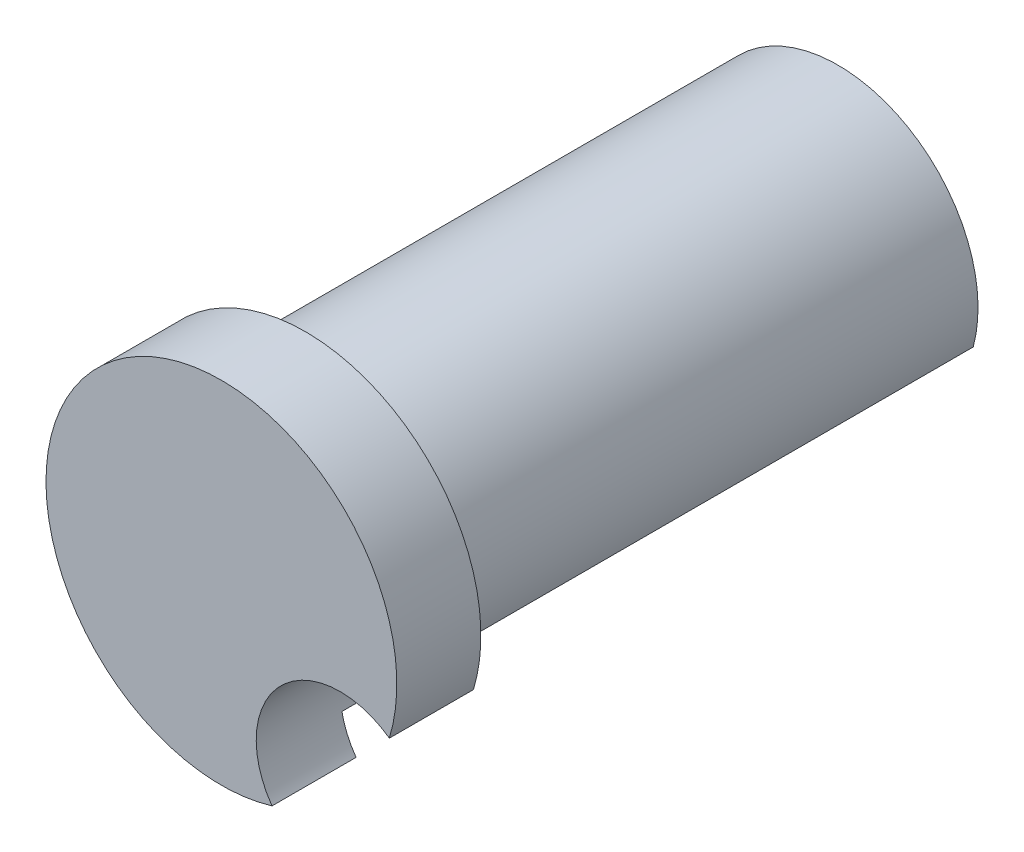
ISO-10303-21;
HEADER;
FILE_DESCRIPTION(('STEP AP214'),'2;1');
FILE_NAME('part.step','',(''),(''),'','','');
FILE_SCHEMA(('AUTOMOTIVE_DESIGN { 1 0 10303 214 1 1 1 1 }'));
ENDSEC;
DATA;
#1=APPLICATION_CONTEXT('core data for automotive mechanical design processes');
#2=APPLICATION_PROTOCOL_DEFINITION('international standard','automotive_design',2000,#1);
#3=PRODUCT_CONTEXT('',#1,'mechanical');
#4=PRODUCT('Part','Part','',(#3));
#5=PRODUCT_RELATED_PRODUCT_CATEGORY('part','',(#4));
#6=PRODUCT_DEFINITION_FORMATION('','',#4);
#7=PRODUCT_DEFINITION_CONTEXT('part definition',#1,'design');
#8=PRODUCT_DEFINITION('design','',#6,#7);
#9=PRODUCT_DEFINITION_SHAPE('','',#8);
#10=(LENGTH_UNIT() NAMED_UNIT(*) SI_UNIT(.MILLI.,.METRE.));
#11=(NAMED_UNIT(*) PLANE_ANGLE_UNIT() SI_UNIT($,.RADIAN.));
#12=(NAMED_UNIT(*) SI_UNIT($,.STERADIAN.) SOLID_ANGLE_UNIT());
#13=UNCERTAINTY_MEASURE_WITH_UNIT(LENGTH_MEASURE(1.E-05),#10,'distance_accuracy_value','');
#14=(GEOMETRIC_REPRESENTATION_CONTEXT(3) GLOBAL_UNCERTAINTY_ASSIGNED_CONTEXT((#13)) GLOBAL_UNIT_ASSIGNED_CONTEXT((#10,
#11,#12)) REPRESENTATION_CONTEXT('',''));
#15=CARTESIAN_POINT('',(0.,0.,0.));
#16=DIRECTION('',(0.,0.,1.));
#17=DIRECTION('',(1.,0.,0.));
#18=AXIS2_PLACEMENT_3D('',#15,#16,#17);
#19=CARTESIAN_POINT('',(7.93750000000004,0.,0.));
#20=DIRECTION('',(0.,0.,-1.));
#21=DIRECTION('',(-1.,0.,0.));
#22=AXIS2_PLACEMENT_3D('',#19,#20,#21);
#23=PLANE('',#22);
#24=CARTESIAN_POINT('',(6.73519209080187,-6.7351920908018,0.));
#25=DIRECTION('',(0.,0.,-1.));
#26=DIRECTION('',(-1.,0.,0.));
#27=AXIS2_PLACEMENT_3D('',#24,#25,#26);
#28=CIRCLE('',#27,4.7625);
#29=CARTESIAN_POINT('',(2.06421859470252,-7.66439220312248,0.));
#30=VERTEX_POINT('',#29);
#31=CARTESIAN_POINT('',(7.66439220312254,-2.06421859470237,0.));
#32=VERTEX_POINT('',#31);
#33=EDGE_CURVE('E80',#30,#32,#28,.T.);
#34=ORIENTED_EDGE('',*,*,#33,.F.);
#35=CARTESIAN_POINT('',(0.,0.,0.));
#36=DIRECTION('',(0.,0.,1.));
#37=DIRECTION('',(1.,0.,0.));
#38=AXIS2_PLACEMENT_3D('',#35,#36,#37);
#39=CIRCLE('',#38,7.93750000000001);
#40=EDGE_CURVE('E92',#32,#30,#39,.T.);
#41=ORIENTED_EDGE('',*,*,#40,.F.);
#42=EDGE_LOOP('',(#34,#41));
#43=FACE_BOUND('',#42,.T.);
#44=ADVANCED_FACE('F43',(#43),#23,.T.);
#45=CARTESIAN_POINT('',(0.,0.,34.925));
#46=DIRECTION('',(0.,0.,1.));
#47=DIRECTION('',(1.,0.,0.));
#48=AXIS2_PLACEMENT_3D('',#45,#46,#47);
#49=PLANE('',#48);
#50=CARTESIAN_POINT('',(6.73519209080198,-6.7351920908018,34.925));
#51=DIRECTION('',(0.,0.,-1.));
#52=DIRECTION('',(-1.,0.,0.));
#53=AXIS2_PLACEMENT_3D('',#50,#51,#52);
#54=CIRCLE('',#53,4.7625);
#55=CARTESIAN_POINT('',(2.86790761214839,-9.51467351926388,34.925));
#56=VERTEX_POINT('',#55);
#57=CARTESIAN_POINT('',(9.51467351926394,-2.86790761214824,34.925));
#58=VERTEX_POINT('',#57);
#59=EDGE_CURVE('E87',#56,#58,#54,.T.);
#60=ORIENTED_EDGE('',*,*,#59,.T.);
#61=CARTESIAN_POINT('',(0.,0.,34.925));
#62=DIRECTION('',(0.,0.,1.));
#63=DIRECTION('',(1.,0.,0.));
#64=AXIS2_PLACEMENT_3D('',#61,#62,#63);
#65=CIRCLE('',#64,9.93750000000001);
#66=EDGE_CURVE('E109',#58,#56,#65,.T.);
#67=ORIENTED_EDGE('',*,*,#66,.T.);
#68=EDGE_LOOP('',(#60,#67));
#69=FACE_BOUND('',#68,.T.);
#70=ADVANCED_FACE('F129',(#69),#49,.T.);
#71=CARTESIAN_POINT('',(0.,0.,34.925));
#72=DIRECTION('',(0.,0.,1.));
#73=DIRECTION('',(1.,0.,0.));
#74=AXIS2_PLACEMENT_3D('',#71,#72,#73);
#75=CYLINDRICAL_SURFACE('',#74,9.93750000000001);
#76=DIRECTION('',(0.,0.,-1.));
#77=VECTOR('',#76,1.);
#78=CARTESIAN_POINT('',(9.51467351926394,-2.86790761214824,17.4625));
#79=LINE('',#78,#77);
#80=CARTESIAN_POINT('',(9.51467351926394,-2.86790761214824,30.1625));
#81=VERTEX_POINT('',#80);
#82=EDGE_CURVE('E96',#81,#58,#79,.F.);
#83=ORIENTED_EDGE('',*,*,#82,.F.);
#84=CARTESIAN_POINT('',(0.,0.,30.1625));
#85=DIRECTION('',(0.,0.,1.));
#86=DIRECTION('',(1.,0.,0.));
#87=AXIS2_PLACEMENT_3D('',#84,#85,#86);
#88=CIRCLE('',#87,9.93750000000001);
#89=CARTESIAN_POINT('',(2.86790761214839,-9.51467351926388,30.1625));
#90=VERTEX_POINT('',#89);
#91=EDGE_CURVE('E100',#81,#90,#88,.T.);
#92=ORIENTED_EDGE('',*,*,#91,.T.);
#93=DIRECTION('',(0.,0.,-1.));
#94=VECTOR('',#93,1.);
#95=CARTESIAN_POINT('',(2.86790761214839,-9.51467351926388,17.4625));
#96=LINE('',#95,#94);
#97=EDGE_CURVE('E121',#56,#90,#96,.T.);
#98=ORIENTED_EDGE('',*,*,#97,.F.);
#99=ORIENTED_EDGE('',*,*,#66,.F.);
#100=EDGE_LOOP('',(#83,#92,#98,#99));
#101=FACE_BOUND('',#100,.T.);
#102=ADVANCED_FACE('F132',(#101),#75,.T.);
#103=CARTESIAN_POINT('',(9.93750000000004,0.,30.1625));
#104=DIRECTION('',(0.,0.,-1.));
#105=DIRECTION('',(-1.,0.,0.));
#106=AXIS2_PLACEMENT_3D('',#103,#104,#105);
#107=PLANE('',#106);
#108=CARTESIAN_POINT('',(6.73519209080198,-6.7351920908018,30.1625));
#109=DIRECTION('',(0.,0.,-1.));
#110=DIRECTION('',(-1.,0.,0.));
#111=AXIS2_PLACEMENT_3D('',#108,#109,#110);
#112=CIRCLE('',#111,4.7625);
#113=CARTESIAN_POINT('',(7.66439220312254,-2.06421859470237,30.1625));
#114=VERTEX_POINT('',#113);
#115=EDGE_CURVE('E64',#114,#81,#112,.T.);
#116=ORIENTED_EDGE('',*,*,#115,.F.);
#117=CARTESIAN_POINT('',(0.,0.,30.1625));
#118=DIRECTION('',(0.,0.,1.));
#119=DIRECTION('',(1.,0.,0.));
#120=AXIS2_PLACEMENT_3D('',#117,#118,#119);
#121=CIRCLE('',#120,7.93750000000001);
#122=CARTESIAN_POINT('',(2.06421859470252,-7.66439220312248,30.1625));
#123=VERTEX_POINT('',#122);
#124=EDGE_CURVE('E94',#114,#123,#121,.T.);
#125=ORIENTED_EDGE('',*,*,#124,.T.);
#126=EDGE_CURVE('E58',#90,#123,#112,.T.);
#127=ORIENTED_EDGE('',*,*,#126,.F.);
#128=ORIENTED_EDGE('',*,*,#91,.F.);
#129=EDGE_LOOP('',(#116,#125,#127,#128));
#130=FACE_BOUND('',#129,.T.);
#131=ADVANCED_FACE('F135',(#130),#107,.T.);
#132=CARTESIAN_POINT('',(0.,0.,34.925));
#133=DIRECTION('',(0.,0.,1.));
#134=DIRECTION('',(1.,0.,0.));
#135=AXIS2_PLACEMENT_3D('',#132,#133,#134);
#136=CYLINDRICAL_SURFACE('',#135,7.93750000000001);
#137=DIRECTION('',(0.,0.,-1.));
#138=VECTOR('',#137,1.);
#139=CARTESIAN_POINT('',(7.66439220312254,-2.06421859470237,17.4625));
#140=LINE('',#139,#138);
#141=EDGE_CURVE('E11',#32,#114,#140,.F.);
#142=ORIENTED_EDGE('',*,*,#141,.F.);
#143=ORIENTED_EDGE('',*,*,#40,.T.);
#144=DIRECTION('',(0.,0.,-1.));
#145=VECTOR('',#144,1.);
#146=CARTESIAN_POINT('',(2.06421859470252,-7.66439220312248,17.4625));
#147=LINE('',#146,#145);
#148=EDGE_CURVE('E51',#123,#30,#147,.T.);
#149=ORIENTED_EDGE('',*,*,#148,.F.);
#150=ORIENTED_EDGE('',*,*,#124,.F.);
#151=EDGE_LOOP('',(#142,#143,#149,#150));
#152=FACE_BOUND('',#151,.T.);
#153=ADVANCED_FACE('F91',(#152),#136,.T.);
#154=CARTESIAN_POINT('',(6.73519209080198,-6.7351920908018,34.925));
#155=DIRECTION('',(0.,0.,-1.));
#156=DIRECTION('',(-1.,0.,0.));
#157=AXIS2_PLACEMENT_3D('',#154,#155,#156);
#158=CYLINDRICAL_SURFACE('',#157,4.7625);
#159=ORIENTED_EDGE('',*,*,#82,.T.);
#160=ORIENTED_EDGE('',*,*,#59,.F.);
#161=ORIENTED_EDGE('',*,*,#97,.T.);
#162=ORIENTED_EDGE('',*,*,#126,.T.);
#163=ORIENTED_EDGE('',*,*,#148,.T.);
#164=ORIENTED_EDGE('',*,*,#33,.T.);
#165=ORIENTED_EDGE('',*,*,#141,.T.);
#166=ORIENTED_EDGE('',*,*,#115,.T.);
#167=EDGE_LOOP('',(#159,#160,#161,#162,#163,#164,#165,#166));
#168=FACE_BOUND('',#167,.T.);
#169=ADVANCED_FACE('F82',(#168),#158,.F.);
#170=CLOSED_SHELL('',(#44,#70,#102,#131,#153,#169));
#171=MANIFOLD_SOLID_BREP('B2',#170);
#172=ADVANCED_BREP_SHAPE_REPRESENTATION('',(#18,#171),#14);
#173=SHAPE_DEFINITION_REPRESENTATION(#9,#172);
ENDSEC;
END-ISO-10303-21;
